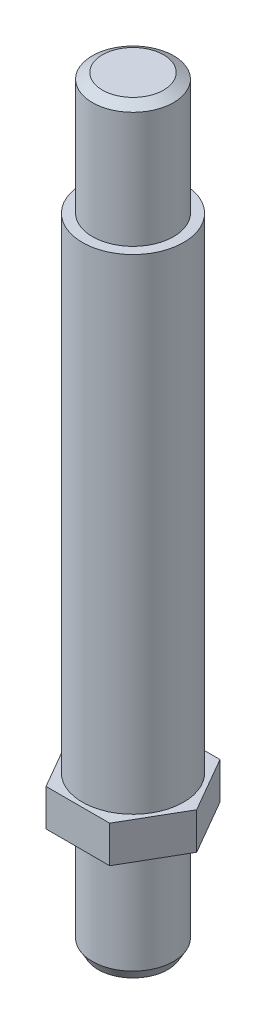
ISO-10303-21;
HEADER;
FILE_DESCRIPTION(('STEP AP214'),'2;1');
FILE_NAME('part.step','',(''),(''),'','','');
FILE_SCHEMA(('AUTOMOTIVE_DESIGN { 1 0 10303 214 1 1 1 1 }'));
ENDSEC;
DATA;
#1=APPLICATION_CONTEXT('core data for automotive mechanical design processes');
#2=APPLICATION_PROTOCOL_DEFINITION('international standard','automotive_design',2000,#1);
#3=PRODUCT_CONTEXT('',#1,'mechanical');
#4=PRODUCT('Part','Part','',(#3));
#5=PRODUCT_RELATED_PRODUCT_CATEGORY('part','',(#4));
#6=PRODUCT_DEFINITION_FORMATION('','',#4);
#7=PRODUCT_DEFINITION_CONTEXT('part definition',#1,'design');
#8=PRODUCT_DEFINITION('design','',#6,#7);
#9=PRODUCT_DEFINITION_SHAPE('','',#8);
#10=(LENGTH_UNIT() NAMED_UNIT(*) SI_UNIT(.MILLI.,.METRE.));
#11=(NAMED_UNIT(*) PLANE_ANGLE_UNIT() SI_UNIT($,.RADIAN.));
#12=(NAMED_UNIT(*) SI_UNIT($,.STERADIAN.) SOLID_ANGLE_UNIT());
#13=UNCERTAINTY_MEASURE_WITH_UNIT(LENGTH_MEASURE(1.E-05),#10,'distance_accuracy_value','');
#14=(GEOMETRIC_REPRESENTATION_CONTEXT(3) GLOBAL_UNCERTAINTY_ASSIGNED_CONTEXT((#13)) GLOBAL_UNIT_ASSIGNED_CONTEXT((#10,
#11,#12)) REPRESENTATION_CONTEXT('',''));
#15=CARTESIAN_POINT('',(0.,0.,0.));
#16=DIRECTION('',(0.,0.,1.));
#17=DIRECTION('',(1.,0.,0.));
#18=AXIS2_PLACEMENT_3D('',#15,#16,#17);
#19=CARTESIAN_POINT('',(0.,109.85,0.));
#20=DIRECTION('',(0.,1.,0.));
#21=DIRECTION('',(0.,0.,1.));
#22=AXIS2_PLACEMENT_3D('',#19,#20,#21);
#23=PLANE('',#22);
#24=CARTESIAN_POINT('',(0.,109.85,0.));
#25=DIRECTION('',(0.,1.,0.));
#26=DIRECTION('',(0.,0.,1.));
#27=AXIS2_PLACEMENT_3D('',#24,#25,#26);
#28=CIRCLE('',#27,8.725);
#29=CARTESIAN_POINT('',(0.,109.85,-8.725));
#30=VERTEX_POINT('',#29);
#31=EDGE_CURVE('E114',#30,#30,#28,.T.);
#32=ORIENTED_EDGE('',*,*,#31,.T.);
#33=EDGE_LOOP('',(#32));
#34=FACE_BOUND('',#33,.T.);
#35=CARTESIAN_POINT('',(0.,109.85,0.));
#36=DIRECTION('',(0.,1.,0.));
#37=DIRECTION('',(0.,0.,1.));
#38=AXIS2_PLACEMENT_3D('',#35,#36,#37);
#39=CIRCLE('',#38,7.);
#40=CARTESIAN_POINT('',(0.,109.85,-7.));
#41=VERTEX_POINT('',#40);
#42=EDGE_CURVE('E325',#41,#41,#39,.T.);
#43=ORIENTED_EDGE('',*,*,#42,.F.);
#44=EDGE_LOOP('',(#43));
#45=FACE_BOUND('',#44,.T.);
#46=ADVANCED_FACE('F36',(#34,#45),#23,.T.);
#47=CARTESIAN_POINT('',(-5.48482755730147,26.35,9.50000000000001));
#48=DIRECTION('',(0.,1.,0.));
#49=DIRECTION('',(0.,0.,1.));
#50=AXIS2_PLACEMENT_3D('',#47,#48,#49);
#51=PLANE('',#50);
#52=DIRECTION('',(0.5,0.,0.866025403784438));
#53=VECTOR('',#52,1.);
#54=CARTESIAN_POINT('',(-5.48482755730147,26.35,9.50000000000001));
#55=LINE('',#54,#53);
#56=CARTESIAN_POINT('',(-10.9696551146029,26.35,0.));
#57=VERTEX_POINT('',#56);
#58=CARTESIAN_POINT('',(-5.48482755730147,26.35,9.50000000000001));
#59=VERTEX_POINT('',#58);
#60=EDGE_CURVE('E128',#57,#59,#55,.T.);
#61=ORIENTED_EDGE('',*,*,#60,.T.);
#62=DIRECTION('',(1.,0.,0.));
#63=VECTOR('',#62,1.);
#64=CARTESIAN_POINT('',(5.48482755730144,26.35,9.5));
#65=LINE('',#64,#63);
#66=CARTESIAN_POINT('',(5.48482755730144,26.35,9.5));
#67=VERTEX_POINT('',#66);
#68=EDGE_CURVE('E105',#59,#67,#65,.T.);
#69=ORIENTED_EDGE('',*,*,#68,.T.);
#70=DIRECTION('',(0.500000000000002,0.,-0.866025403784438));
#71=VECTOR('',#70,1.);
#72=CARTESIAN_POINT('',(10.9696551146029,26.35,0.));
#73=LINE('',#72,#71);
#74=CARTESIAN_POINT('',(10.9696551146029,26.35,0.));
#75=VERTEX_POINT('',#74);
#76=EDGE_CURVE('E131',#67,#75,#73,.T.);
#77=ORIENTED_EDGE('',*,*,#76,.T.);
#78=DIRECTION('',(-0.500000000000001,0.,-0.866025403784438));
#79=VECTOR('',#78,1.);
#80=CARTESIAN_POINT('',(5.48482755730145,26.35,-9.5));
#81=LINE('',#80,#79);
#82=CARTESIAN_POINT('',(5.48482755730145,26.35,-9.5));
#83=VERTEX_POINT('',#82);
#84=EDGE_CURVE('E133',#75,#83,#81,.T.);
#85=ORIENTED_EDGE('',*,*,#84,.T.);
#86=DIRECTION('',(-1.,0.,0.));
#87=VECTOR('',#86,1.);
#88=CARTESIAN_POINT('',(-5.48482755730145,26.35,-9.5));
#89=LINE('',#88,#87);
#90=CARTESIAN_POINT('',(-5.48482755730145,26.35,-9.5));
#91=VERTEX_POINT('',#90);
#92=EDGE_CURVE('E56',#83,#91,#89,.T.);
#93=ORIENTED_EDGE('',*,*,#92,.T.);
#94=DIRECTION('',(-0.500000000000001,0.,0.866025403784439));
#95=VECTOR('',#94,1.);
#96=CARTESIAN_POINT('',(-10.9696551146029,26.35,0.));
#97=LINE('',#96,#95);
#98=EDGE_CURVE('E51',#91,#57,#97,.T.);
#99=ORIENTED_EDGE('',*,*,#98,.T.);
#100=EDGE_LOOP('',(#61,#69,#77,#85,#93,#99));
#101=FACE_BOUND('',#100,.T.);
#102=CARTESIAN_POINT('',(0.,26.35,0.));
#103=DIRECTION('',(0.,1.,0.));
#104=DIRECTION('',(0.,0.,1.));
#105=AXIS2_PLACEMENT_3D('',#102,#103,#104);
#106=CIRCLE('',#105,8.725);
#107=CARTESIAN_POINT('',(0.,26.35,-8.725));
#108=VERTEX_POINT('',#107);
#109=EDGE_CURVE('E117',#108,#108,#106,.T.);
#110=ORIENTED_EDGE('',*,*,#109,.F.);
#111=EDGE_LOOP('',(#110));
#112=FACE_BOUND('',#111,.T.);
#113=ADVANCED_FACE('F172',(#101,#112),#51,.T.);
#114=CARTESIAN_POINT('',(0.,20.,0.));
#115=DIRECTION('',(0.,-1.,0.));
#116=DIRECTION('',(0.,0.,-1.));
#117=AXIS2_PLACEMENT_3D('',#114,#115,#116);
#118=CYLINDRICAL_SURFACE('',#117,7.);
#119=CARTESIAN_POINT('',(0.,1.73205080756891,0.));
#120=DIRECTION('',(0.,1.,0.));
#121=DIRECTION('',(0.,0.,1.));
#122=AXIS2_PLACEMENT_3D('',#119,#120,#121);
#123=CIRCLE('',#122,7.);
#124=CARTESIAN_POINT('',(0.,1.73205080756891,7.));
#125=VERTEX_POINT('',#124);
#126=EDGE_CURVE('E150',#125,#125,#123,.T.);
#127=ORIENTED_EDGE('',*,*,#126,.T.);
#128=EDGE_LOOP('',(#127));
#129=FACE_BOUND('',#128,.T.);
#130=CARTESIAN_POINT('',(0.,20.,0.));
#131=DIRECTION('',(0.,1.,0.));
#132=DIRECTION('',(0.,0.,1.));
#133=AXIS2_PLACEMENT_3D('',#130,#131,#132);
#134=CIRCLE('',#133,7.);
#135=CARTESIAN_POINT('',(0.,20.,7.));
#136=VERTEX_POINT('',#135);
#137=EDGE_CURVE('E108',#136,#136,#134,.T.);
#138=ORIENTED_EDGE('',*,*,#137,.F.);
#139=EDGE_LOOP('',(#138));
#140=FACE_BOUND('',#139,.T.);
#141=ADVANCED_FACE('F38',(#129,#140),#118,.T.);
#142=CARTESIAN_POINT('',(0.,0.,0.));
#143=DIRECTION('',(0.,1.,0.));
#144=DIRECTION('',(0.,0.,1.));
#145=AXIS2_PLACEMENT_3D('',#142,#143,#144);
#146=PLANE('',#145);
#147=CARTESIAN_POINT('',(0.,0.,0.));
#148=DIRECTION('',(0.,1.,0.));
#149=DIRECTION('',(0.,0.,1.));
#150=AXIS2_PLACEMENT_3D('',#147,#148,#149);
#151=CIRCLE('',#150,5.99999999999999);
#152=CARTESIAN_POINT('',(0.,0.,5.99999999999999));
#153=VERTEX_POINT('',#152);
#154=EDGE_CURVE('E153',#153,#153,#151,.F.);
#155=ORIENTED_EDGE('',*,*,#154,.T.);
#156=EDGE_LOOP('',(#155));
#157=FACE_BOUND('',#156,.T.);
#158=ADVANCED_FACE('F190',(#157),#146,.F.);
#159=CARTESIAN_POINT('',(-5.48482755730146,20.,9.5));
#160=DIRECTION('',(0.,1.,0.));
#161=DIRECTION('',(0.,0.,1.));
#162=AXIS2_PLACEMENT_3D('',#159,#160,#161);
#163=PLANE('',#162);
#164=DIRECTION('',(0.5,0.,0.866025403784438));
#165=VECTOR('',#164,1.);
#166=CARTESIAN_POINT('',(-5.48482755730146,20.,9.5));
#167=LINE('',#166,#165);
#168=CARTESIAN_POINT('',(-10.9696551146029,20.,0.));
#169=VERTEX_POINT('',#168);
#170=CARTESIAN_POINT('',(-5.48482755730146,20.,9.5));
#171=VERTEX_POINT('',#170);
#172=EDGE_CURVE('E95',#169,#171,#167,.T.);
#173=ORIENTED_EDGE('',*,*,#172,.F.);
#174=DIRECTION('',(-0.500000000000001,0.,0.866025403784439));
#175=VECTOR('',#174,1.);
#176=CARTESIAN_POINT('',(-10.9696551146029,20.,0.));
#177=LINE('',#176,#175);
#178=CARTESIAN_POINT('',(-5.48482755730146,20.,-9.49999999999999));
#179=VERTEX_POINT('',#178);
#180=EDGE_CURVE('E126',#179,#169,#177,.T.);
#181=ORIENTED_EDGE('',*,*,#180,.F.);
#182=DIRECTION('',(-1.,0.,0.));
#183=VECTOR('',#182,1.);
#184=CARTESIAN_POINT('',(-5.48482755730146,20.,-9.49999999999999));
#185=LINE('',#184,#183);
#186=CARTESIAN_POINT('',(5.48482755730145,20.,-9.5));
#187=VERTEX_POINT('',#186);
#188=EDGE_CURVE('E124',#187,#179,#185,.T.);
#189=ORIENTED_EDGE('',*,*,#188,.F.);
#190=DIRECTION('',(-0.500000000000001,0.,-0.866025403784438));
#191=VECTOR('',#190,1.);
#192=CARTESIAN_POINT('',(5.48482755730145,20.,-9.5));
#193=LINE('',#192,#191);
#194=CARTESIAN_POINT('',(10.9696551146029,20.,0.));
#195=VERTEX_POINT('',#194);
#196=EDGE_CURVE('E122',#195,#187,#193,.T.);
#197=ORIENTED_EDGE('',*,*,#196,.F.);
#198=DIRECTION('',(0.500000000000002,0.,-0.866025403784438));
#199=VECTOR('',#198,1.);
#200=CARTESIAN_POINT('',(10.9696551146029,20.,0.));
#201=LINE('',#200,#199);
#202=CARTESIAN_POINT('',(5.48482755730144,20.,9.5));
#203=VERTEX_POINT('',#202);
#204=EDGE_CURVE('E97',#203,#195,#201,.T.);
#205=ORIENTED_EDGE('',*,*,#204,.F.);
#206=DIRECTION('',(1.,0.,0.));
#207=VECTOR('',#206,1.);
#208=CARTESIAN_POINT('',(5.48482755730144,20.,9.5));
#209=LINE('',#208,#207);
#210=EDGE_CURVE('E89',#171,#203,#209,.T.);
#211=ORIENTED_EDGE('',*,*,#210,.F.);
#212=EDGE_LOOP('',(#173,#181,#189,#197,#205,#211));
#213=FACE_BOUND('',#212,.T.);
#214=ORIENTED_EDGE('',*,*,#137,.T.);
#215=EDGE_LOOP('',(#214));
#216=FACE_BOUND('',#215,.T.);
#217=ADVANCED_FACE('F91',(#213,#216),#163,.F.);
#218=CARTESIAN_POINT('',(-5.48482755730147,26.35,9.50000000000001));
#219=DIRECTION('',(0.866025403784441,0.,-0.5));
#220=DIRECTION('',(-0.500000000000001,0.,-0.866025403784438));
#221=AXIS2_PLACEMENT_3D('',#218,#219,#220);
#222=PLANE('',#221);
#223=ORIENTED_EDGE('',*,*,#172,.T.);
#224=DIRECTION('',(0.,-1.,0.));
#225=VECTOR('',#224,1.);
#226=CARTESIAN_POINT('',(-5.48482755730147,26.35,9.50000000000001));
#227=LINE('',#226,#225);
#228=EDGE_CURVE('E103',#59,#171,#227,.T.);
#229=ORIENTED_EDGE('',*,*,#228,.F.);
#230=ORIENTED_EDGE('',*,*,#60,.F.);
#231=DIRECTION('',(0.,-1.,0.));
#232=VECTOR('',#231,1.);
#233=CARTESIAN_POINT('',(-10.9696551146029,26.35,0.));
#234=LINE('',#233,#232);
#235=EDGE_CURVE('E113',#57,#169,#234,.T.);
#236=ORIENTED_EDGE('',*,*,#235,.T.);
#237=EDGE_LOOP('',(#223,#229,#230,#236));
#238=FACE_BOUND('',#237,.T.);
#239=ADVANCED_FACE('F112',(#238),#222,.F.);
#240=CARTESIAN_POINT('',(5.48482755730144,26.35,9.5));
#241=DIRECTION('',(0.,0.,-1.));
#242=DIRECTION('',(-1.,0.,0.));
#243=AXIS2_PLACEMENT_3D('',#240,#241,#242);
#244=PLANE('',#243);
#245=ORIENTED_EDGE('',*,*,#210,.T.);
#246=DIRECTION('',(0.,-1.,0.));
#247=VECTOR('',#246,1.);
#248=CARTESIAN_POINT('',(5.48482755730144,26.35,9.5));
#249=LINE('',#248,#247);
#250=EDGE_CURVE('E109',#67,#203,#249,.T.);
#251=ORIENTED_EDGE('',*,*,#250,.F.);
#252=ORIENTED_EDGE('',*,*,#68,.F.);
#253=ORIENTED_EDGE('',*,*,#228,.T.);
#254=EDGE_LOOP('',(#245,#251,#252,#253));
#255=FACE_BOUND('',#254,.T.);
#256=ADVANCED_FACE('F104',(#255),#244,.F.);
#257=CARTESIAN_POINT('',(10.9696551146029,26.35,0.));
#258=DIRECTION('',(-0.866025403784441,0.,-0.500000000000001));
#259=DIRECTION('',(-0.500000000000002,0.,0.866025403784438));
#260=AXIS2_PLACEMENT_3D('',#257,#258,#259);
#261=PLANE('',#260);
#262=ORIENTED_EDGE('',*,*,#204,.T.);
#263=DIRECTION('',(0.,-1.,0.));
#264=VECTOR('',#263,1.);
#265=CARTESIAN_POINT('',(10.9696551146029,26.35,0.));
#266=LINE('',#265,#264);
#267=EDGE_CURVE('E144',#75,#195,#266,.T.);
#268=ORIENTED_EDGE('',*,*,#267,.F.);
#269=ORIENTED_EDGE('',*,*,#76,.F.);
#270=ORIENTED_EDGE('',*,*,#250,.T.);
#271=EDGE_LOOP('',(#262,#268,#269,#270));
#272=FACE_BOUND('',#271,.T.);
#273=ADVANCED_FACE('F202',(#272),#261,.F.);
#274=CARTESIAN_POINT('',(5.48482755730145,26.35,-9.5));
#275=DIRECTION('',(-0.866025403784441,0.,0.5));
#276=DIRECTION('',(0.500000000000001,0.,0.866025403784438));
#277=AXIS2_PLACEMENT_3D('',#274,#275,#276);
#278=PLANE('',#277);
#279=ORIENTED_EDGE('',*,*,#196,.T.);
#280=DIRECTION('',(0.,-1.,0.));
#281=VECTOR('',#280,1.);
#282=CARTESIAN_POINT('',(5.48482755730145,26.35,-9.5));
#283=LINE('',#282,#281);
#284=EDGE_CURVE('E141',#83,#187,#283,.T.);
#285=ORIENTED_EDGE('',*,*,#284,.F.);
#286=ORIENTED_EDGE('',*,*,#84,.F.);
#287=ORIENTED_EDGE('',*,*,#267,.T.);
#288=EDGE_LOOP('',(#279,#285,#286,#287));
#289=FACE_BOUND('',#288,.T.);
#290=ADVANCED_FACE('F198',(#289),#278,.F.);
#291=CARTESIAN_POINT('',(-5.48482755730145,26.35,-9.5));
#292=DIRECTION('',(0.,0.,1.));
#293=DIRECTION('',(1.,0.,0.));
#294=AXIS2_PLACEMENT_3D('',#291,#292,#293);
#295=PLANE('',#294);
#296=ORIENTED_EDGE('',*,*,#188,.T.);
#297=DIRECTION('',(0.,-1.,0.));
#298=VECTOR('',#297,1.);
#299=CARTESIAN_POINT('',(-5.48482755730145,26.35,-9.5));
#300=LINE('',#299,#298);
#301=EDGE_CURVE('E138',#91,#179,#300,.T.);
#302=ORIENTED_EDGE('',*,*,#301,.F.);
#303=ORIENTED_EDGE('',*,*,#92,.F.);
#304=ORIENTED_EDGE('',*,*,#284,.T.);
#305=EDGE_LOOP('',(#296,#302,#303,#304));
#306=FACE_BOUND('',#305,.T.);
#307=ADVANCED_FACE('F194',(#306),#295,.F.);
#308=CARTESIAN_POINT('',(-10.9696551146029,26.35,0.));
#309=DIRECTION('',(0.866025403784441,0.,0.5));
#310=DIRECTION('',(0.500000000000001,0.,-0.866025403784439));
#311=AXIS2_PLACEMENT_3D('',#308,#309,#310);
#312=PLANE('',#311);
#313=ORIENTED_EDGE('',*,*,#180,.T.);
#314=ORIENTED_EDGE('',*,*,#235,.F.);
#315=ORIENTED_EDGE('',*,*,#98,.F.);
#316=ORIENTED_EDGE('',*,*,#301,.T.);
#317=EDGE_LOOP('',(#313,#314,#315,#316));
#318=FACE_BOUND('',#317,.T.);
#319=ADVANCED_FACE('F187',(#318),#312,.F.);
#320=CARTESIAN_POINT('',(0.,109.85,0.));
#321=DIRECTION('',(0.,-1.,0.));
#322=DIRECTION('',(0.,0.,-1.));
#323=AXIS2_PLACEMENT_3D('',#320,#321,#322);
#324=CYLINDRICAL_SURFACE('',#323,8.725);
#325=CARTESIAN_POINT('',(0.,109.85,-8.725));
#326=CARTESIAN_POINT('',(0.,108.980208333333,-8.725));
#327=CARTESIAN_POINT('',(0.,108.110416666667,-8.725));
#328=CARTESIAN_POINT('',(0.,106.370833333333,-8.725));
#329=CARTESIAN_POINT('',(0.,105.501041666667,-8.725));
#330=CARTESIAN_POINT('',(0.,103.761458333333,-8.725));
#331=CARTESIAN_POINT('',(0.,102.891666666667,-8.725));
#332=CARTESIAN_POINT('',(0.,101.152083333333,-8.725));
#333=CARTESIAN_POINT('',(0.,100.282291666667,-8.725));
#334=CARTESIAN_POINT('',(0.,98.5427083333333,-8.725));
#335=CARTESIAN_POINT('',(0.,97.6729166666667,-8.725));
#336=CARTESIAN_POINT('',(0.,95.9333333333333,-8.725));
#337=CARTESIAN_POINT('',(0.,95.0635416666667,-8.725));
#338=CARTESIAN_POINT('',(0.,93.3239583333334,-8.725));
#339=CARTESIAN_POINT('',(0.,92.4541666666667,-8.725));
#340=CARTESIAN_POINT('',(0.,90.7145833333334,-8.725));
#341=CARTESIAN_POINT('',(0.,89.8447916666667,-8.725));
#342=CARTESIAN_POINT('',(0.,88.1052083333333,-8.725));
#343=CARTESIAN_POINT('',(0.,87.2354166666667,-8.725));
#344=CARTESIAN_POINT('',(0.,85.4958333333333,-8.725));
#345=CARTESIAN_POINT('',(0.,84.6260416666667,-8.725));
#346=CARTESIAN_POINT('',(0.,82.8864583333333,-8.725));
#347=CARTESIAN_POINT('',(0.,82.0166666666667,-8.725));
#348=CARTESIAN_POINT('',(0.,80.2770833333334,-8.725));
#349=CARTESIAN_POINT('',(0.,79.4072916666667,-8.725));
#350=CARTESIAN_POINT('',(0.,77.6677083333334,-8.725));
#351=CARTESIAN_POINT('',(0.,76.7979166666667,-8.725));
#352=CARTESIAN_POINT('',(0.,75.0583333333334,-8.725));
#353=CARTESIAN_POINT('',(0.,74.1885416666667,-8.725));
#354=CARTESIAN_POINT('',(0.,72.4489583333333,-8.725));
#355=CARTESIAN_POINT('',(0.,71.5791666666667,-8.725));
#356=CARTESIAN_POINT('',(0.,69.8395833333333,-8.725));
#357=CARTESIAN_POINT('',(0.,68.9697916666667,-8.725));
#358=CARTESIAN_POINT('',(0.,67.2302083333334,-8.725));
#359=CARTESIAN_POINT('',(0.,66.3604166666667,-8.725));
#360=CARTESIAN_POINT('',(0.,64.6208333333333,-8.725));
#361=CARTESIAN_POINT('',(0.,63.7510416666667,-8.725));
#362=CARTESIAN_POINT('',(0.,62.0114583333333,-8.725));
#363=CARTESIAN_POINT('',(0.,61.1416666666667,-8.725));
#364=CARTESIAN_POINT('',(0.,59.4020833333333,-8.725));
#365=CARTESIAN_POINT('',(0.,58.5322916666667,-8.725));
#366=CARTESIAN_POINT('',(0.,56.7927083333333,-8.725));
#367=CARTESIAN_POINT('',(0.,55.9229166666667,-8.725));
#368=CARTESIAN_POINT('',(0.,54.1833333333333,-8.725));
#369=CARTESIAN_POINT('',(0.,53.3135416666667,-8.725));
#370=CARTESIAN_POINT('',(0.,51.5739583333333,-8.725));
#371=CARTESIAN_POINT('',(0.,50.7041666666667,-8.725));
#372=CARTESIAN_POINT('',(0.,48.9645833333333,-8.725));
#373=CARTESIAN_POINT('',(0.,48.0947916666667,-8.725));
#374=CARTESIAN_POINT('',(0.,46.3552083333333,-8.725));
#375=CARTESIAN_POINT('',(0.,45.4854166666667,-8.725));
#376=CARTESIAN_POINT('',(0.,43.7458333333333,-8.725));
#377=CARTESIAN_POINT('',(0.,42.8760416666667,-8.725));
#378=CARTESIAN_POINT('',(0.,41.1364583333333,-8.725));
#379=CARTESIAN_POINT('',(0.,40.2666666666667,-8.725));
#380=CARTESIAN_POINT('',(0.,38.5270833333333,-8.725));
#381=CARTESIAN_POINT('',(0.,37.6572916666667,-8.725));
#382=CARTESIAN_POINT('',(0.,35.9177083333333,-8.725));
#383=CARTESIAN_POINT('',(0.,35.0479166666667,-8.725));
#384=CARTESIAN_POINT('',(0.,33.3083333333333,-8.725));
#385=CARTESIAN_POINT('',(0.,32.4385416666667,-8.725));
#386=CARTESIAN_POINT('',(0.,30.6989583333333,-8.725));
#387=CARTESIAN_POINT('',(0.,29.8291666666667,-8.725));
#388=CARTESIAN_POINT('',(0.,28.0895833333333,-8.725));
#389=CARTESIAN_POINT('',(0.,27.2197916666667,-8.725));
#390=CARTESIAN_POINT('',(0.,26.35,-8.725));
#391=B_SPLINE_CURVE_WITH_KNOTS('',3,(#325,#326,#327,#328,#329,#330,#331,#332,#333,#334,#335,
#336,#337,#338,#339,#340,#341,#342,#343,#344,#345,#346,#347,#348,#349,#350,#351,#352,#353,#354,
#355,#356,#357,#358,#359,#360,#361,#362,#363,#364,#365,#366,#367,#368,#369,#370,#371,#372,#373,
#374,#375,#376,#377,#378,#379,#380,#381,#382,#383,#384,#385,#386,#387,#388,#389,#390),
.UNSPECIFIED.,.F.,.F.,(4,2,2,2,2,2,2,2,2,2,2,2,2,2,2,2,2,2,2,2,2,2,2,2,2,2,2,2,2,2,2,2,4),(0.,
2.609375,5.21874999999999,7.82812499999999,10.4375,13.046875,15.65625,18.265625,20.875,
23.484375,26.09375,28.703125,31.3125,33.921875,36.53125,39.140625,41.75,44.359375,46.96875,
49.578125,52.1875,54.796875,57.40625,60.015625,62.625,65.234375,67.84375,70.453125,73.0625,
75.671875,78.28125,80.890625,83.5),.UNSPECIFIED.);
#392=EDGE_CURVE('BSEAM184',#30,#108,#391,.T.);
#393=ORIENTED_EDGE('',*,*,#31,.F.);
#394=ORIENTED_EDGE('',*,*,#109,.T.);
#395=ORIENTED_EDGE('',*,*,#392,.T.);
#396=ORIENTED_EDGE('',*,*,#392,.F.);
#397=EDGE_LOOP('',(#393,#395,#394,#396));
#398=FACE_BOUND('',#397,.T.);
#399=ADVANCED_FACE('F184',(#398),#324,.T.);
#400=CARTESIAN_POINT('',(0.,130.85,0.));
#401=DIRECTION('',(0.,-1.,0.));
#402=DIRECTION('',(0.,0.,-1.));
#403=AXIS2_PLACEMENT_3D('',#400,#401,#402);
#404=CYLINDRICAL_SURFACE('',#403,7.);
#405=CARTESIAN_POINT('',(0.,129.85,0.));
#406=DIRECTION('',(0.,1.,0.));
#407=DIRECTION('',(0.,0.,1.));
#408=AXIS2_PLACEMENT_3D('',#405,#406,#407);
#409=CIRCLE('',#408,7.);
#410=CARTESIAN_POINT('',(0.,129.85,-7.));
#411=VERTEX_POINT('',#410);
#412=EDGE_CURVE('E11',#411,#411,#409,.F.);
#413=CARTESIAN_POINT('',(0.,129.85,-7.));
#414=CARTESIAN_POINT('',(0.,129.641666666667,-7.));
#415=CARTESIAN_POINT('',(0.,129.433333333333,-7.));
#416=CARTESIAN_POINT('',(0.,129.016666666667,-7.));
#417=CARTESIAN_POINT('',(0.,128.808333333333,-7.));
#418=CARTESIAN_POINT('',(0.,128.391666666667,-7.));
#419=CARTESIAN_POINT('',(0.,128.183333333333,-7.));
#420=CARTESIAN_POINT('',(0.,127.766666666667,-7.));
#421=CARTESIAN_POINT('',(0.,127.558333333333,-7.));
#422=CARTESIAN_POINT('',(0.,127.141666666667,-7.));
#423=CARTESIAN_POINT('',(0.,126.933333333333,-7.));
#424=CARTESIAN_POINT('',(0.,126.516666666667,-7.));
#425=CARTESIAN_POINT('',(0.,126.308333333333,-7.));
#426=CARTESIAN_POINT('',(0.,125.891666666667,-7.));
#427=CARTESIAN_POINT('',(0.,125.683333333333,-7.));
#428=CARTESIAN_POINT('',(0.,125.266666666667,-7.));
#429=CARTESIAN_POINT('',(0.,125.058333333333,-7.));
#430=CARTESIAN_POINT('',(0.,124.641666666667,-7.));
#431=CARTESIAN_POINT('',(0.,124.433333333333,-7.));
#432=CARTESIAN_POINT('',(0.,124.016666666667,-7.));
#433=CARTESIAN_POINT('',(0.,123.808333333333,-7.));
#434=CARTESIAN_POINT('',(0.,123.391666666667,-7.));
#435=CARTESIAN_POINT('',(0.,123.183333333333,-7.));
#436=CARTESIAN_POINT('',(0.,122.766666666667,-7.));
#437=CARTESIAN_POINT('',(0.,122.558333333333,-7.));
#438=CARTESIAN_POINT('',(0.,122.141666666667,-7.));
#439=CARTESIAN_POINT('',(0.,121.933333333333,-7.));
#440=CARTESIAN_POINT('',(0.,121.516666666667,-7.));
#441=CARTESIAN_POINT('',(0.,121.308333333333,-7.));
#442=CARTESIAN_POINT('',(0.,120.891666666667,-7.));
#443=CARTESIAN_POINT('',(0.,120.683333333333,-7.));
#444=CARTESIAN_POINT('',(0.,120.266666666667,-7.));
#445=CARTESIAN_POINT('',(0.,120.058333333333,-7.));
#446=CARTESIAN_POINT('',(0.,119.641666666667,-7.));
#447=CARTESIAN_POINT('',(0.,119.433333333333,-7.));
#448=CARTESIAN_POINT('',(0.,119.016666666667,-7.));
#449=CARTESIAN_POINT('',(0.,118.808333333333,-7.));
#450=CARTESIAN_POINT('',(0.,118.391666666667,-7.));
#451=CARTESIAN_POINT('',(0.,118.183333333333,-7.));
#452=CARTESIAN_POINT('',(0.,117.766666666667,-7.));
#453=CARTESIAN_POINT('',(0.,117.558333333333,-7.));
#454=CARTESIAN_POINT('',(0.,117.141666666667,-7.));
#455=CARTESIAN_POINT('',(0.,116.933333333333,-7.));
#456=CARTESIAN_POINT('',(0.,116.516666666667,-7.));
#457=CARTESIAN_POINT('',(0.,116.308333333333,-7.));
#458=CARTESIAN_POINT('',(0.,115.891666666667,-7.));
#459=CARTESIAN_POINT('',(0.,115.683333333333,-7.));
#460=CARTESIAN_POINT('',(0.,115.266666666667,-7.));
#461=CARTESIAN_POINT('',(0.,115.058333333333,-7.));
#462=CARTESIAN_POINT('',(0.,114.641666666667,-7.));
#463=CARTESIAN_POINT('',(0.,114.433333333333,-7.));
#464=CARTESIAN_POINT('',(0.,114.016666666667,-7.));
#465=CARTESIAN_POINT('',(0.,113.808333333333,-7.));
#466=CARTESIAN_POINT('',(0.,113.391666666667,-7.));
#467=CARTESIAN_POINT('',(0.,113.183333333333,-7.));
#468=CARTESIAN_POINT('',(0.,112.766666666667,-7.));
#469=CARTESIAN_POINT('',(0.,112.558333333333,-7.));
#470=CARTESIAN_POINT('',(0.,112.141666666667,-7.));
#471=CARTESIAN_POINT('',(0.,111.933333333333,-7.));
#472=CARTESIAN_POINT('',(0.,111.516666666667,-7.));
#473=CARTESIAN_POINT('',(0.,111.308333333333,-7.));
#474=CARTESIAN_POINT('',(0.,110.891666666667,-7.));
#475=CARTESIAN_POINT('',(0.,110.683333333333,-7.));
#476=CARTESIAN_POINT('',(0.,110.266666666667,-7.));
#477=CARTESIAN_POINT('',(0.,110.058333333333,-7.));
#478=CARTESIAN_POINT('',(0.,109.85,-7.));
#479=B_SPLINE_CURVE_WITH_KNOTS('',3,(#413,#414,#415,#416,#417,#418,#419,#420,#421,#422,#423,
#424,#425,#426,#427,#428,#429,#430,#431,#432,#433,#434,#435,#436,#437,#438,#439,#440,#441,#442,
#443,#444,#445,#446,#447,#448,#449,#450,#451,#452,#453,#454,#455,#456,#457,#458,#459,#460,#461,
#462,#463,#464,#465,#466,#467,#468,#469,#470,#471,#472,#473,#474,#475,#476,#477,#478),
.UNSPECIFIED.,.F.,.F.,(4,2,2,2,2,2,2,2,2,2,2,2,2,2,2,2,2,2,2,2,2,2,2,2,2,2,2,2,2,2,2,2,4),(0.,
0.624999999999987,1.24999999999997,1.87499999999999,2.49999999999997,3.12499999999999,
3.74999999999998,4.37499999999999,4.99999999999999,5.62499999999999,6.24999999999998,
6.87499999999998,7.49999999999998,8.12499999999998,8.74999999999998,9.37499999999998,
9.99999999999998,10.625,11.25,11.875,12.5,13.125,13.75,14.375,15.,15.625,16.25,16.875,17.5,
18.125,18.75,19.375,20.),.UNSPECIFIED.);
#480=EDGE_CURVE('BSEAM182',#411,#41,#479,.T.);
#481=ORIENTED_EDGE('',*,*,#412,.T.);
#482=ORIENTED_EDGE('',*,*,#42,.T.);
#483=ORIENTED_EDGE('',*,*,#480,.T.);
#484=ORIENTED_EDGE('',*,*,#480,.F.);
#485=EDGE_LOOP('',(#481,#483,#482,#484));
#486=FACE_BOUND('',#485,.T.);
#487=ADVANCED_FACE('F182',(#486),#404,.T.);
#488=CARTESIAN_POINT('',(0.,130.85,0.));
#489=DIRECTION('',(0.,1.,0.));
#490=DIRECTION('',(0.,0.,1.));
#491=AXIS2_PLACEMENT_3D('',#488,#489,#490);
#492=PLANE('',#491);
#493=CARTESIAN_POINT('',(0.,130.85,0.));
#494=DIRECTION('',(0.,1.,0.));
#495=DIRECTION('',(0.,0.,1.));
#496=AXIS2_PLACEMENT_3D('',#493,#494,#495);
#497=CIRCLE('',#496,5.26794919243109);
#498=CARTESIAN_POINT('',(0.,130.85,5.26794919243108));
#499=VERTEX_POINT('',#498);
#500=EDGE_CURVE('E44',#499,#499,#497,.T.);
#501=ORIENTED_EDGE('',*,*,#500,.T.);
#502=EDGE_LOOP('',(#501));
#503=FACE_BOUND('',#502,.T.);
#504=ADVANCED_FACE('F158',(#503),#492,.T.);
#505=CARTESIAN_POINT('',(0.,1.73205080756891,0.));
#506=DIRECTION('',(0.,1.,0.));
#507=DIRECTION('',(0.,0.,1.));
#508=AXIS2_PLACEMENT_3D('',#505,#506,#507);
#509=CONICAL_SURFACE('',#508,7.,0.523598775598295);
#510=ORIENTED_EDGE('',*,*,#154,.F.);
#511=EDGE_LOOP('',(#510));
#512=FACE_BOUND('',#511,.T.);
#513=ORIENTED_EDGE('',*,*,#126,.F.);
#514=EDGE_LOOP('',(#513));
#515=FACE_BOUND('',#514,.T.);
#516=ADVANCED_FACE('F162',(#512,#515),#509,.T.);
#517=CARTESIAN_POINT('',(0.,130.85,0.));
#518=DIRECTION('',(0.,-1.,0.));
#519=DIRECTION('',(0.,0.,-1.));
#520=AXIS2_PLACEMENT_3D('',#517,#518,#519);
#521=CONICAL_SURFACE('',#520,5.26794919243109,1.04719755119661);
#522=ORIENTED_EDGE('',*,*,#412,.F.);
#523=EDGE_LOOP('',(#522));
#524=FACE_BOUND('',#523,.T.);
#525=ORIENTED_EDGE('',*,*,#500,.F.);
#526=EDGE_LOOP('',(#525));
#527=FACE_BOUND('',#526,.T.);
#528=ADVANCED_FACE('F160',(#524,#527),#521,.T.);
#529=CLOSED_SHELL('',(#46,#113,#141,#158,#217,#239,#256,#273,#290,#307,#319,#399,#487,#504,#516,#528));
#530=MANIFOLD_SOLID_BREP('B2',#529);
#531=ADVANCED_BREP_SHAPE_REPRESENTATION('',(#18,#530),#14);
#532=SHAPE_DEFINITION_REPRESENTATION(#9,#531);
ENDSEC;
END-ISO-10303-21;
